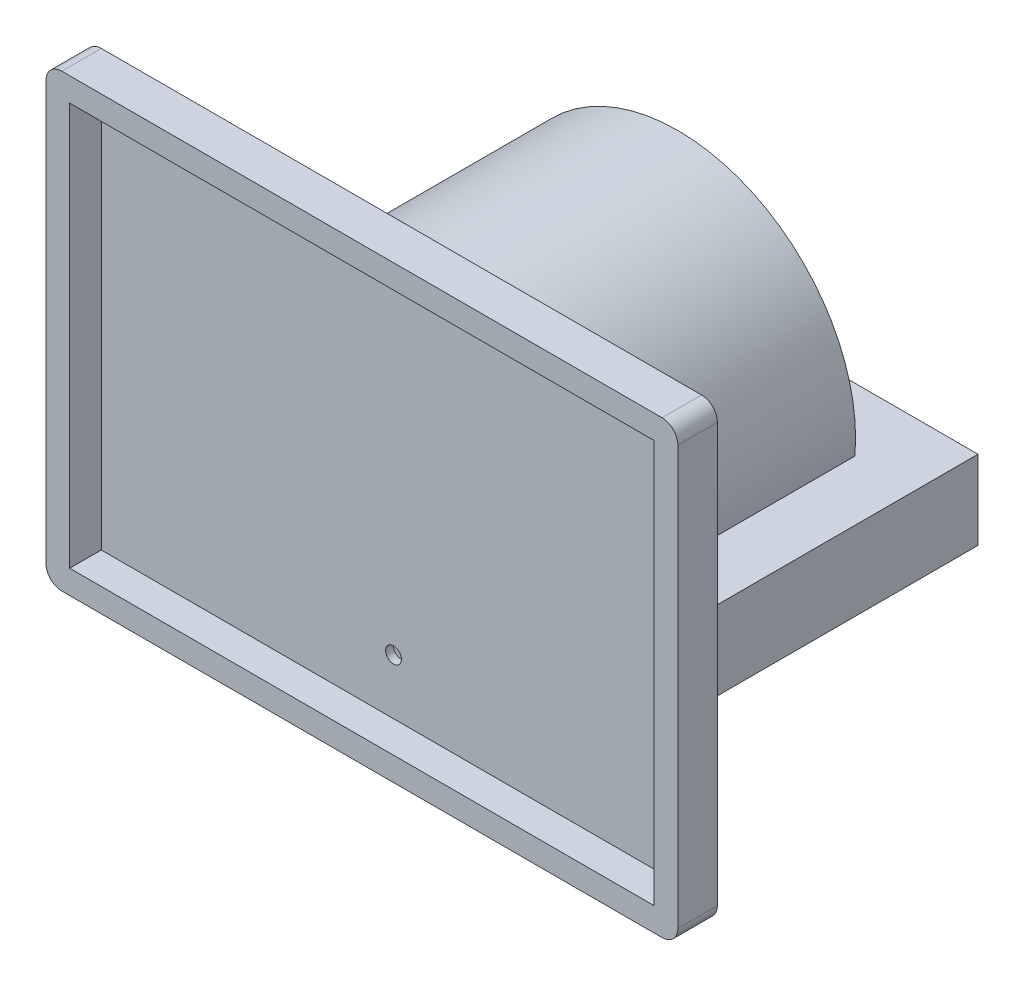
from build123d import *

# Parameters (mm, degrees)
ESQUISSE1_W             = 80
ESQUISSE1_H             = 57
BOSS_EXTRU_1_DEPTH      = 5
ESQUISSE2_W             = 74
ESQUISSE2_H             = 51
ENL_V_MAT_EXTRU_1_DEPTH = 4
ESQUISSE3_R             = 1
ENL_V_MAT_EXTRU_2_DEPTH = 99.310731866
ESQUISSE4_R             = 22.5
BOSS_EXTRU_2_DEPTH      = 35
ESQUISSE5_W             = 60
ESQUISSE5_H             = 10
BOSS_EXTRU_3_DEPTH      = 35
ESQUISSE6_W             = 60
ESQUISSE6_H             = 10
BOSS_EXTRU_4_DEPTH      = 8
ESQUISSE7_W             = 5
ESQUISSE7_H             = 5
BOSS_EXTRU_5_DEPTH      = 6
ESQUISSE8_R             = 1.25
ENL_V_MAT_EXTRU_3_DEPTH = 6
ESQUISSE9_R             = 1
ENL_V_MAT_EXTRU_4_DEPTH = 3
ESQUISSE10_W            = 64
ESQUISSE10_H            = 49
BOSS_EXTRU_6_DEPTH      = 1
CONG_1_R                = 2


with BuildPart() as part:
    # Esquisse1 → Boss.-Extru.1 (new body)
    with BuildSketch(Plane.XY):
        with Locations((-40, 28.5)):
            Rectangle(ESQUISSE1_W, ESQUISSE1_H)
    extrude(amount=BOSS_EXTRU_1_DEPTH)

    # Esquisse2 → Enl_v. mat.-Extru.1 (cut)
    with BuildSketch(Plane.XY.offset(5)):
        with Locations((-40, 28.5)):
            Rectangle(ESQUISSE2_W, ESQUISSE2_H)
    extrude(amount=-ENL_V_MAT_EXTRU_1_DEPTH, mode=Mode.SUBTRACT)

    # Esquisse3 → Enl_v. mat.-Extru.2 (cut, through all)
    with BuildSketch(Plane.XY.offset(1)):
        with Locations((-40, 10)):
            Circle(ESQUISSE3_R)
    extrude(amount=-ENL_V_MAT_EXTRU_2_DEPTH, mode=Mode.SUBTRACT)

    # Esquisse4 → Boss.-Extru.2 (add)
    with BuildSketch(Plane(origin=(0, 0, 0), x_dir=(-1, 0, 0), z_dir=(0, 0, -1))):
        with Locations(Location((40, 27, 0), (0, 0, 180))):
            Circle(ESQUISSE4_R)
    extrude(amount=BOSS_EXTRU_2_DEPTH)



with BuildPart() as body_2:
    # Esquisse5 → Boss.-Extru.3 (new body)
    with BuildSketch(Plane(origin=(0, 0, -35), x_dir=(-1, 0, 0), z_dir=(0, 0, -1))):
        with Locations((40, 20)):
            Rectangle(ESQUISSE5_W, ESQUISSE5_H)
    extrude(amount=-BOSS_EXTRU_3_DEPTH)


with BuildPart() as part_1:
    add(part.part)

    add(body_2.part)  # Boss.-Extru.4 merges body 2
    # Esquisse6 → Boss.-Extru.4 (add)
    with BuildSketch(Plane(origin=(0, 0, -35), x_dir=(-1, 0, 0), z_dir=(0, 0, -1))):
        with Locations((40, 20)):
            Rectangle(ESQUISSE6_W, ESQUISSE6_H)
    extrude(amount=BOSS_EXTRU_4_DEPTH)

    # Esquisse7 → Boss.-Extru.5 (add)
    with BuildSketch(Plane(origin=(0, 0, -35), x_dir=(-1, 0, 0), z_dir=(0, 0, -1))):
        with Locations((32.5, 27.5)):
            Rectangle(ESQUISSE7_W, ESQUISSE7_H)
        with Locations((47.5, 27.5)):
            Rectangle(ESQUISSE7_W, ESQUISSE7_H)
    extrude(amount=BOSS_EXTRU_5_DEPTH)

    # Esquisse8 → Enl_v. mat.-Extru.3 (cut)
    with BuildSketch(Plane(origin=(0, 0, -35), x_dir=(-1, 0, 0), z_dir=(0, 0, -1))):
        with Locations((32.5, 27.5)):
            Circle(ESQUISSE8_R)
        with Locations((47.5, 27.5)):
            Circle(ESQUISSE8_R)
    extrude(amount=ENL_V_MAT_EXTRU_3_DEPTH, mode=Mode.SUBTRACT)

    # Esquisse9 → Enl_v. mat.-Extru.4 (cut)
    with BuildSketch(Plane(origin=(0, 30, 0), x_dir=(1, 0, 0), z_dir=(0, 1, 0))):
        with Locations(Location((-47.5, 38.5, 0), (0, 0, 270))):
            Circle(ESQUISSE9_R)
        with Locations(Location((-32.5, 38.5, 0), (0, 0, 270))):
            Circle(ESQUISSE9_R)
    extrude(amount=-ENL_V_MAT_EXTRU_4_DEPTH, mode=Mode.SUBTRACT)

    # Esquisse10 → Boss.-Extru.6 (add)
    with BuildSketch(Plane(origin=(0, 0, 0), x_dir=(-1, 0, 0), z_dir=(0, 0, -1))):
        with Locations((40, 26.5)):
            Rectangle(ESQUISSE10_W, ESQUISSE10_H)
    extrude(amount=BOSS_EXTRU_6_DEPTH)

    # Cong_1
    cong_1_edges = [part_1.edges().sort_by_distance(p)[0] for p in [
        (-80, 57, 2.5),
        (0, 57, 2.5),
        (0, 0, 2.5),
        (-80, 0, 2.5),
    ]]
    fillet(cong_1_edges, radius=CONG_1_R)


solid = part_1.part
